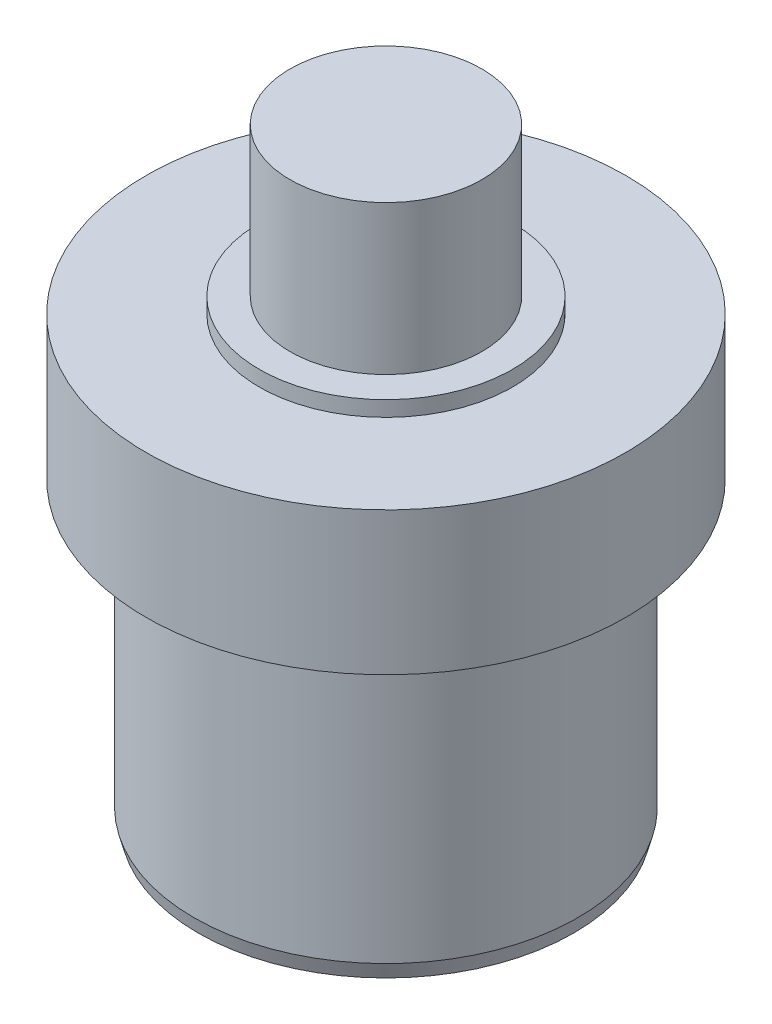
from build123d import *

# Parameters (mm, degrees)
SKETCH2_R      = 3.96875
EXTRUDE1_DEPTH = 2.3622
SKETCH3_R      = 3.175
EXTRUDE2_DEPTH = 4.953
SKETCH4_R      = 2.0955
EXTRUDE3_DEPTH = 0.254
SKETCH5_R      = 1.5875
EXTRUDE4_DEPTH = 2.4638
CHAMFER1_SIZE  = 0.254
CHAMFER1_SIZE2 = 0.068059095


with BuildPart() as part:
    # Sketch2 → Extrude1 (new body)
    with BuildSketch(Plane(origin=(0, 0, 0), x_dir=(1, 0, 0), z_dir=(0, 1, 0))):
        with Locations(Location((0, 0, 0), (0, 0, 270))):
            Circle(SKETCH2_R)
    extrude(amount=EXTRUDE1_DEPTH)

    # Sketch3 → Extrude2 (add)
    with BuildSketch(Plane.XZ):
        with Locations(Location((0, 0, 0), (0, 0, 90))):
            Circle(SKETCH3_R)
    extrude(amount=EXTRUDE2_DEPTH)

    # Sketch4 → Extrude3 (add)
    with BuildSketch(Plane(origin=(0, 2.3622, 0), x_dir=(-1, 0, 0), z_dir=(0, 1, 0))):
        with Locations(Location((0, 0, 0), (0, 0, 90))):
            Circle(SKETCH4_R)
    extrude(amount=EXTRUDE3_DEPTH)

    # Sketch5 → Extrude4 (add)
    with BuildSketch(Plane(origin=(0, 2.6162, 0), x_dir=(-1, 0, 0), z_dir=(0, 1, 0))):
        with Locations(Location((0, 0, 0), (0, 0, 90))):
            Circle(SKETCH5_R)
    extrude(amount=EXTRUDE4_DEPTH)

    # Chamfer1
    chamfer1_edges = [part.edges().sort_by_distance(p)[0] for p in [
        (0, -4.953, -3.175),
    ]]
    chamfer1_side = [part.faces().sort_by_distance(p)[0] for p in [
        (0, -2.4765, -3.175),
    ]]
    chamfer(chamfer1_edges, length=CHAMFER1_SIZE, length2=CHAMFER1_SIZE2, reference=chamfer1_side[0])


solid = part.part
